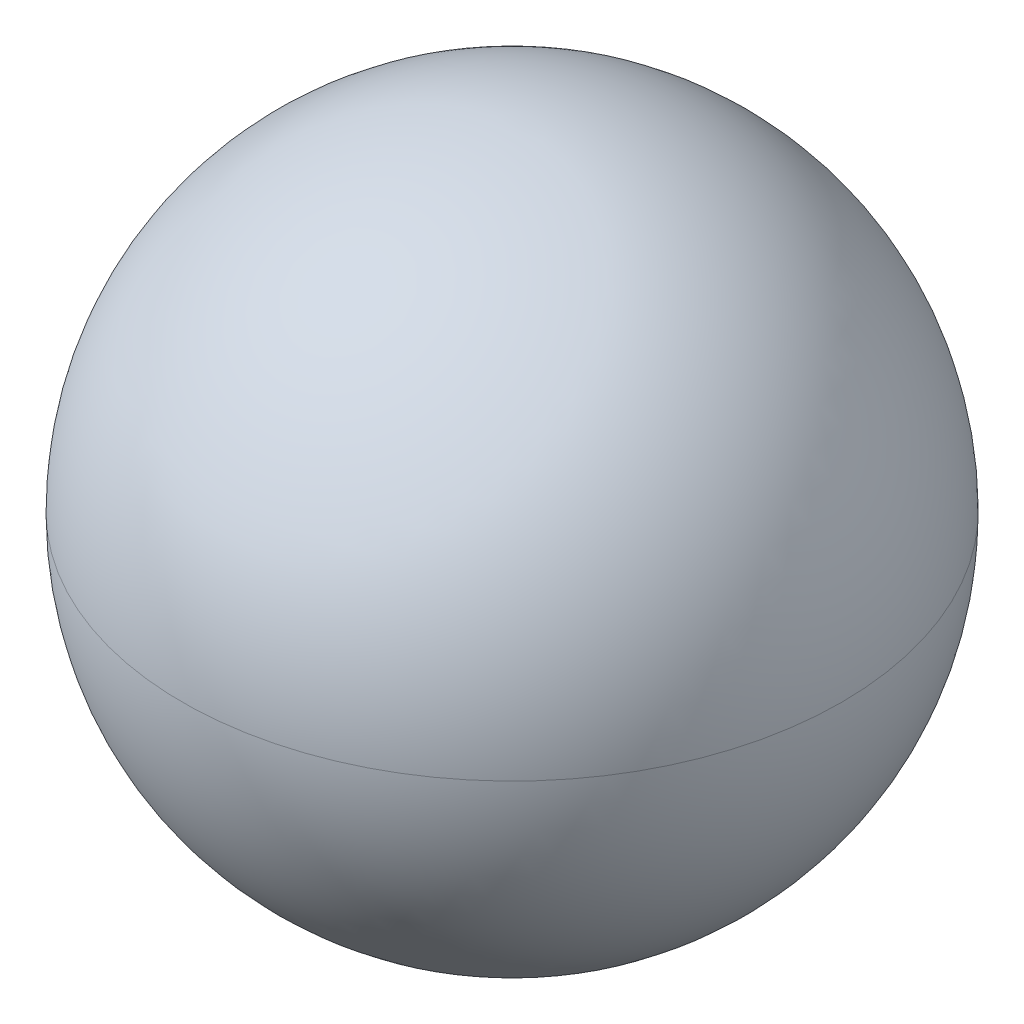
ISO-10303-21;
HEADER;
FILE_DESCRIPTION(('STEP AP214'),'2;1');
FILE_NAME('part.step','',(''),(''),'','','');
FILE_SCHEMA(('AUTOMOTIVE_DESIGN { 1 0 10303 214 1 1 1 1 }'));
ENDSEC;
DATA;
#1=APPLICATION_CONTEXT('core data for automotive mechanical design processes');
#2=APPLICATION_PROTOCOL_DEFINITION('international standard','automotive_design',2000,#1);
#3=PRODUCT_CONTEXT('',#1,'mechanical');
#4=PRODUCT('Part','Part','',(#3));
#5=PRODUCT_RELATED_PRODUCT_CATEGORY('part','',(#4));
#6=PRODUCT_DEFINITION_FORMATION('','',#4);
#7=PRODUCT_DEFINITION_CONTEXT('part definition',#1,'design');
#8=PRODUCT_DEFINITION('design','',#6,#7);
#9=PRODUCT_DEFINITION_SHAPE('','',#8);
#10=(LENGTH_UNIT() NAMED_UNIT(*) SI_UNIT(.MILLI.,.METRE.));
#11=(NAMED_UNIT(*) PLANE_ANGLE_UNIT() SI_UNIT($,.RADIAN.));
#12=(NAMED_UNIT(*) SI_UNIT($,.STERADIAN.) SOLID_ANGLE_UNIT());
#13=UNCERTAINTY_MEASURE_WITH_UNIT(LENGTH_MEASURE(1.E-05),#10,'distance_accuracy_value','');
#14=(GEOMETRIC_REPRESENTATION_CONTEXT(3) GLOBAL_UNCERTAINTY_ASSIGNED_CONTEXT((#13)) GLOBAL_UNIT_ASSIGNED_CONTEXT((#10,
#11,#12)) REPRESENTATION_CONTEXT('',''));
#15=CARTESIAN_POINT('',(0.,0.,0.));
#16=DIRECTION('',(0.,0.,1.));
#17=DIRECTION('',(1.,0.,0.));
#18=AXIS2_PLACEMENT_3D('',#15,#16,#17);
#19=CARTESIAN_POINT('',(0.,0.,0.));
#20=DIRECTION('',(0.,1.,0.));
#21=DIRECTION('',(1.,0.,0.));
#22=AXIS2_PLACEMENT_3D('',#19,#20,#21);
#23=SPHERICAL_SURFACE('',#22,2.);
#24=CARTESIAN_POINT('',(0.,0.,-1.85404962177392));
#25=DIRECTION('',(0.,0.,1.));
#26=DIRECTION('',(1.,0.,0.));
#27=AXIS2_PLACEMENT_3D('',#24,#25,#26);
#28=CIRCLE('',#27,0.75);
#29=CARTESIAN_POINT('',(-0.75,0.,-1.85404962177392));
#30=VERTEX_POINT('',#29);
#31=CARTESIAN_POINT('',(0.75,0.,-1.85404962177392));
#32=VERTEX_POINT('',#31);
#33=EDGE_CURVE('E54',#30,#32,#28,.T.);
#34=ORIENTED_EDGE('',*,*,#33,.T.);
#35=CARTESIAN_POINT('',(0.,0.,0.));
#36=DIRECTION('',(0.,-1.,0.));
#37=DIRECTION('',(0.,0.,-1.));
#38=AXIS2_PLACEMENT_3D('',#35,#36,#37);
#39=CIRCLE('',#38,2.);
#40=EDGE_CURVE('E11',#32,#30,#39,.T.);
#41=ORIENTED_EDGE('',*,*,#40,.T.);
#42=EDGE_LOOP('',(#34,#41));
#43=FACE_BOUND('',#42,.T.);
#44=ADVANCED_FACE('F36',(#43),#23,.T.);
#45=ORIENTED_EDGE('',*,*,#40,.F.);
#46=EDGE_CURVE('E45',#32,#30,#28,.T.);
#47=ORIENTED_EDGE('',*,*,#46,.T.);
#48=EDGE_LOOP('',(#45,#47));
#49=FACE_BOUND('',#48,.T.);
#50=ADVANCED_FACE('F38',(#49),#23,.T.);
#51=CARTESIAN_POINT('',(0.,0.,0.));
#52=DIRECTION('',(0.,0.,1.));
#53=DIRECTION('',(1.,0.,0.));
#54=AXIS2_PLACEMENT_3D('',#51,#52,#53);
#55=PLANE('',#54);
#56=CARTESIAN_POINT('',(0.,0.,0.));
#57=DIRECTION('',(0.,0.,-1.));
#58=DIRECTION('',(-1.,0.,0.));
#59=AXIS2_PLACEMENT_3D('',#56,#57,#58);
#60=CIRCLE('',#59,0.5);
#61=CARTESIAN_POINT('',(-0.5,0.,0.));
#62=VERTEX_POINT('',#61);
#63=EDGE_CURVE('E62',#62,#62,#60,.T.);
#64=ORIENTED_EDGE('',*,*,#63,.F.);
#65=EDGE_LOOP('',(#64));
#66=FACE_BOUND('',#65,.T.);
#67=CARTESIAN_POINT('',(0.,0.,0.));
#68=DIRECTION('',(0.,0.,1.));
#69=DIRECTION('',(1.,0.,0.));
#70=AXIS2_PLACEMENT_3D('',#67,#68,#69);
#71=CIRCLE('',#70,0.75);
#72=CARTESIAN_POINT('',(0.75,0.,0.));
#73=VERTEX_POINT('',#72);
#74=EDGE_CURVE('E56',#73,#73,#71,.T.);
#75=ORIENTED_EDGE('',*,*,#74,.F.);
#76=EDGE_LOOP('',(#75));
#77=FACE_BOUND('',#76,.T.);
#78=ADVANCED_FACE('F76',(#66,#77),#55,.F.);
#79=CARTESIAN_POINT('',(0.,0.,-2.001));
#80=DIRECTION('',(0.,0.,1.));
#81=DIRECTION('',(1.,0.,0.));
#82=AXIS2_PLACEMENT_3D('',#79,#80,#81);
#83=CYLINDRICAL_SURFACE('',#82,0.75);
#84=ORIENTED_EDGE('',*,*,#74,.T.);
#85=EDGE_LOOP('',(#84));
#86=FACE_BOUND('',#85,.T.);
#87=ORIENTED_EDGE('',*,*,#46,.F.);
#88=ORIENTED_EDGE('',*,*,#33,.F.);
#89=EDGE_LOOP('',(#87,#88));
#90=FACE_BOUND('',#89,.T.);
#91=ADVANCED_FACE('F57',(#86,#90),#83,.F.);
#92=CARTESIAN_POINT('',(0.,0.,1.));
#93=DIRECTION('',(0.,0.,-1.));
#94=DIRECTION('',(-1.,0.,0.));
#95=AXIS2_PLACEMENT_3D('',#92,#93,#94);
#96=CYLINDRICAL_SURFACE('',#95,0.5);
#97=CARTESIAN_POINT('',(0.,0.,1.));
#98=DIRECTION('',(0.,0.,-1.));
#99=DIRECTION('',(-1.,0.,0.));
#100=AXIS2_PLACEMENT_3D('',#97,#98,#99);
#101=CIRCLE('',#100,0.5);
#102=CARTESIAN_POINT('',(-0.5,0.,1.));
#103=VERTEX_POINT('',#102);
#104=EDGE_CURVE('E61',#103,#103,#101,.T.);
#105=ORIENTED_EDGE('',*,*,#104,.F.);
#106=EDGE_LOOP('',(#105));
#107=FACE_BOUND('',#106,.T.);
#108=ORIENTED_EDGE('',*,*,#63,.T.);
#109=EDGE_LOOP('',(#108));
#110=FACE_BOUND('',#109,.T.);
#111=ADVANCED_FACE('F70',(#107,#110),#96,.F.);
#112=CARTESIAN_POINT('',(0.,0.,1.));
#113=DIRECTION('',(0.,0.,-1.));
#114=DIRECTION('',(-1.,0.,0.));
#115=AXIS2_PLACEMENT_3D('',#112,#113,#114);
#116=PLANE('',#115);
#117=ORIENTED_EDGE('',*,*,#104,.T.);
#118=EDGE_LOOP('',(#117));
#119=FACE_BOUND('',#118,.T.);
#120=ADVANCED_FACE('F68',(#119),#116,.T.);
#121=CLOSED_SHELL('',(#44,#50,#78,#91,#111,#120));
#122=MANIFOLD_SOLID_BREP('B2',#121);
#123=ADVANCED_BREP_SHAPE_REPRESENTATION('',(#18,#122),#14);
#124=SHAPE_DEFINITION_REPRESENTATION(#9,#123);
ENDSEC;
END-ISO-10303-21;
